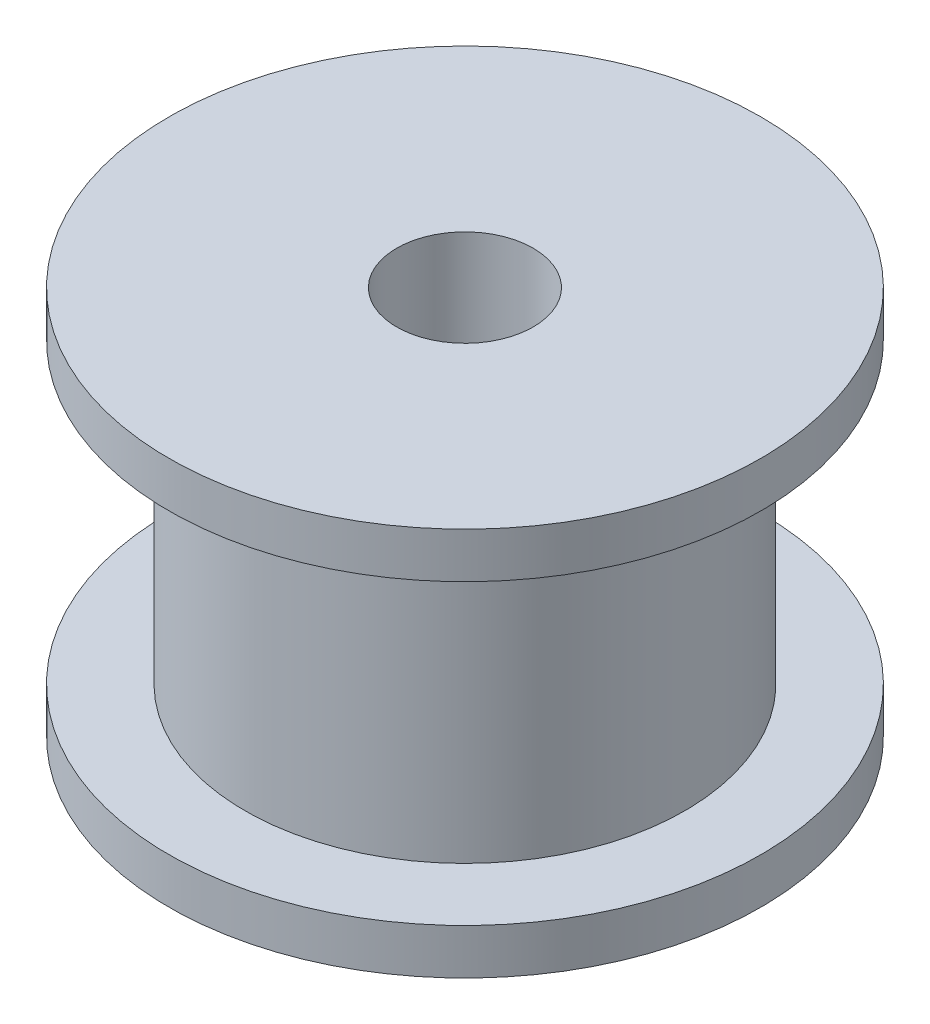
ISO-10303-21;
HEADER;
FILE_DESCRIPTION(('STEP AP214'),'2;1');
FILE_NAME('part.step','',(''),(''),'','','');
FILE_SCHEMA(('AUTOMOTIVE_DESIGN { 1 0 10303 214 1 1 1 1 }'));
ENDSEC;
DATA;
#1=APPLICATION_CONTEXT('core data for automotive mechanical design processes');
#2=APPLICATION_PROTOCOL_DEFINITION('international standard','automotive_design',2000,#1);
#3=PRODUCT_CONTEXT('',#1,'mechanical');
#4=PRODUCT('Part','Part','',(#3));
#5=PRODUCT_RELATED_PRODUCT_CATEGORY('part','',(#4));
#6=PRODUCT_DEFINITION_FORMATION('','',#4);
#7=PRODUCT_DEFINITION_CONTEXT('part definition',#1,'design');
#8=PRODUCT_DEFINITION('design','',#6,#7);
#9=PRODUCT_DEFINITION_SHAPE('','',#8);
#10=(LENGTH_UNIT() NAMED_UNIT(*) SI_UNIT(.MILLI.,.METRE.));
#11=(NAMED_UNIT(*) PLANE_ANGLE_UNIT() SI_UNIT($,.RADIAN.));
#12=(NAMED_UNIT(*) SI_UNIT($,.STERADIAN.) SOLID_ANGLE_UNIT());
#13=UNCERTAINTY_MEASURE_WITH_UNIT(LENGTH_MEASURE(1.E-05),#10,'distance_accuracy_value','');
#14=(GEOMETRIC_REPRESENTATION_CONTEXT(3) GLOBAL_UNCERTAINTY_ASSIGNED_CONTEXT((#13)) GLOBAL_UNIT_ASSIGNED_CONTEXT((#10,
#11,#12)) REPRESENTATION_CONTEXT('',''));
#15=CARTESIAN_POINT('',(0.,0.,0.));
#16=DIRECTION('',(0.,0.,1.));
#17=DIRECTION('',(1.,0.,0.));
#18=AXIS2_PLACEMENT_3D('',#15,#16,#17);
#19=CARTESIAN_POINT('',(6.5,0.,0.));
#20=DIRECTION('',(0.,-1.,0.));
#21=DIRECTION('',(0.,0.,-1.));
#22=AXIS2_PLACEMENT_3D('',#19,#20,#21);
#23=PLANE('',#22);
#24=CARTESIAN_POINT('',(0.,0.,0.));
#25=DIRECTION('',(0.,-1.,0.));
#26=DIRECTION('',(0.,0.,-1.));
#27=AXIS2_PLACEMENT_3D('',#24,#25,#26);
#28=CIRCLE('',#27,6.5);
#29=CARTESIAN_POINT('',(0.,0.,-6.5));
#30=VERTEX_POINT('',#29);
#31=EDGE_CURVE('E60',#30,#30,#28,.T.);
#32=ORIENTED_EDGE('',*,*,#31,.T.);
#33=EDGE_LOOP('',(#32));
#34=FACE_BOUND('',#33,.T.);
#35=CARTESIAN_POINT('',(0.,0.,0.));
#36=DIRECTION('',(0.,-1.,0.));
#37=DIRECTION('',(0.,0.,-1.));
#38=AXIS2_PLACEMENT_3D('',#35,#36,#37);
#39=CIRCLE('',#38,1.5);
#40=CARTESIAN_POINT('',(0.,0.,-1.5));
#41=VERTEX_POINT('',#40);
#42=EDGE_CURVE('E10',#41,#41,#39,.T.);
#43=ORIENTED_EDGE('',*,*,#42,.F.);
#44=EDGE_LOOP('',(#43));
#45=FACE_BOUND('',#44,.T.);
#46=ADVANCED_FACE('F32',(#34,#45),#23,.T.);
#47=CARTESIAN_POINT('',(0.,0.,0.));
#48=DIRECTION('',(0.,-1.,0.));
#49=DIRECTION('',(0.,0.,-1.));
#50=AXIS2_PLACEMENT_3D('',#47,#48,#49);
#51=CYLINDRICAL_SURFACE('',#50,1.5);
#52=ORIENTED_EDGE('',*,*,#42,.T.);
#53=EDGE_LOOP('',(#52));
#54=FACE_BOUND('',#53,.T.);
#55=CARTESIAN_POINT('',(0.,8.54,0.));
#56=DIRECTION('',(0.,-1.,0.));
#57=DIRECTION('',(0.,0.,-1.));
#58=AXIS2_PLACEMENT_3D('',#55,#56,#57);
#59=CIRCLE('',#58,1.5);
#60=CARTESIAN_POINT('',(0.,8.54,-1.5));
#61=VERTEX_POINT('',#60);
#62=EDGE_CURVE('E38',#61,#61,#59,.T.);
#63=ORIENTED_EDGE('',*,*,#62,.F.);
#64=EDGE_LOOP('',(#63));
#65=FACE_BOUND('',#64,.T.);
#66=ADVANCED_FACE('F78',(#54,#65),#51,.F.);
#67=CARTESIAN_POINT('',(1.5,8.54,0.));
#68=DIRECTION('',(0.,1.,0.));
#69=DIRECTION('',(0.,0.,1.));
#70=AXIS2_PLACEMENT_3D('',#67,#68,#69);
#71=PLANE('',#70);
#72=ORIENTED_EDGE('',*,*,#62,.T.);
#73=EDGE_LOOP('',(#72));
#74=FACE_BOUND('',#73,.T.);
#75=CARTESIAN_POINT('',(0.,8.54,0.));
#76=DIRECTION('',(0.,-1.,0.));
#77=DIRECTION('',(0.,0.,-1.));
#78=AXIS2_PLACEMENT_3D('',#75,#76,#77);
#79=CIRCLE('',#78,6.5);
#80=CARTESIAN_POINT('',(0.,8.54,-6.5));
#81=VERTEX_POINT('',#80);
#82=EDGE_CURVE('E42',#81,#81,#79,.T.);
#83=ORIENTED_EDGE('',*,*,#82,.F.);
#84=EDGE_LOOP('',(#83));
#85=FACE_BOUND('',#84,.T.);
#86=ADVANCED_FACE('F82',(#74,#85),#71,.T.);
#87=CARTESIAN_POINT('',(0.,0.,0.));
#88=DIRECTION('',(0.,-1.,0.));
#89=DIRECTION('',(0.,0.,-1.));
#90=AXIS2_PLACEMENT_3D('',#87,#88,#89);
#91=CYLINDRICAL_SURFACE('',#90,6.5);
#92=ORIENTED_EDGE('',*,*,#82,.T.);
#93=EDGE_LOOP('',(#92));
#94=FACE_BOUND('',#93,.T.);
#95=CARTESIAN_POINT('',(0.,7.54,0.));
#96=DIRECTION('',(0.,-1.,0.));
#97=DIRECTION('',(0.,0.,-1.));
#98=AXIS2_PLACEMENT_3D('',#95,#96,#97);
#99=CIRCLE('',#98,6.5);
#100=CARTESIAN_POINT('',(0.,7.54,-6.5));
#101=VERTEX_POINT('',#100);
#102=EDGE_CURVE('E46',#101,#101,#99,.T.);
#103=ORIENTED_EDGE('',*,*,#102,.F.);
#104=EDGE_LOOP('',(#103));
#105=FACE_BOUND('',#104,.T.);
#106=ADVANCED_FACE('F86',(#94,#105),#91,.T.);
#107=CARTESIAN_POINT('',(6.5,7.54,0.));
#108=DIRECTION('',(0.,-1.,0.));
#109=DIRECTION('',(0.,0.,-1.));
#110=AXIS2_PLACEMENT_3D('',#107,#108,#109);
#111=PLANE('',#110);
#112=ORIENTED_EDGE('',*,*,#102,.T.);
#113=EDGE_LOOP('',(#112));
#114=FACE_BOUND('',#113,.T.);
#115=CARTESIAN_POINT('',(0.,7.54,0.));
#116=DIRECTION('',(0.,-1.,0.));
#117=DIRECTION('',(0.,0.,-1.));
#118=AXIS2_PLACEMENT_3D('',#115,#116,#117);
#119=CIRCLE('',#118,4.83);
#120=CARTESIAN_POINT('',(0.,7.54,-4.83));
#121=VERTEX_POINT('',#120);
#122=EDGE_CURVE('E51',#121,#121,#119,.T.);
#123=ORIENTED_EDGE('',*,*,#122,.F.);
#124=EDGE_LOOP('',(#123));
#125=FACE_BOUND('',#124,.T.);
#126=ADVANCED_FACE('F92',(#114,#125),#111,.T.);
#127=CARTESIAN_POINT('',(0.,0.,0.));
#128=DIRECTION('',(0.,-1.,0.));
#129=DIRECTION('',(0.,0.,-1.));
#130=AXIS2_PLACEMENT_3D('',#127,#128,#129);
#131=CYLINDRICAL_SURFACE('',#130,4.83);
#132=ORIENTED_EDGE('',*,*,#122,.T.);
#133=EDGE_LOOP('',(#132));
#134=FACE_BOUND('',#133,.T.);
#135=CARTESIAN_POINT('',(0.,1.,0.));
#136=DIRECTION('',(0.,-1.,0.));
#137=DIRECTION('',(0.,0.,-1.));
#138=AXIS2_PLACEMENT_3D('',#135,#136,#137);
#139=CIRCLE('',#138,4.83);
#140=CARTESIAN_POINT('',(0.,1.,-4.83));
#141=VERTEX_POINT('',#140);
#142=EDGE_CURVE('E54',#141,#141,#139,.T.);
#143=ORIENTED_EDGE('',*,*,#142,.F.);
#144=EDGE_LOOP('',(#143));
#145=FACE_BOUND('',#144,.T.);
#146=ADVANCED_FACE('F74',(#134,#145),#131,.T.);
#147=CARTESIAN_POINT('',(4.83,1.,0.));
#148=DIRECTION('',(0.,1.,0.));
#149=DIRECTION('',(0.,0.,1.));
#150=AXIS2_PLACEMENT_3D('',#147,#148,#149);
#151=PLANE('',#150);
#152=ORIENTED_EDGE('',*,*,#142,.T.);
#153=EDGE_LOOP('',(#152));
#154=FACE_BOUND('',#153,.T.);
#155=CARTESIAN_POINT('',(0.,1.,0.));
#156=DIRECTION('',(0.,-1.,0.));
#157=DIRECTION('',(0.,0.,-1.));
#158=AXIS2_PLACEMENT_3D('',#155,#156,#157);
#159=CIRCLE('',#158,6.5);
#160=CARTESIAN_POINT('',(0.,1.,-6.5));
#161=VERTEX_POINT('',#160);
#162=EDGE_CURVE('E57',#161,#161,#159,.T.);
#163=ORIENTED_EDGE('',*,*,#162,.F.);
#164=EDGE_LOOP('',(#163));
#165=FACE_BOUND('',#164,.T.);
#166=ADVANCED_FACE('F68',(#154,#165),#151,.T.);
#167=CARTESIAN_POINT('',(0.,0.,0.));
#168=DIRECTION('',(0.,-1.,0.));
#169=DIRECTION('',(0.,0.,-1.));
#170=AXIS2_PLACEMENT_3D('',#167,#168,#169);
#171=CYLINDRICAL_SURFACE('',#170,6.5);
#172=ORIENTED_EDGE('',*,*,#162,.T.);
#173=EDGE_LOOP('',(#172));
#174=FACE_BOUND('',#173,.T.);
#175=ORIENTED_EDGE('',*,*,#31,.F.);
#176=EDGE_LOOP('',(#175));
#177=FACE_BOUND('',#176,.T.);
#178=ADVANCED_FACE('F66',(#174,#177),#171,.T.);
#179=CLOSED_SHELL('',(#46,#66,#86,#106,#126,#146,#166,#178));
#180=MANIFOLD_SOLID_BREP('B2',#179);
#181=ADVANCED_BREP_SHAPE_REPRESENTATION('',(#18,#180),#14);
#182=SHAPE_DEFINITION_REPRESENTATION(#9,#181);
ENDSEC;
END-ISO-10303-21;
